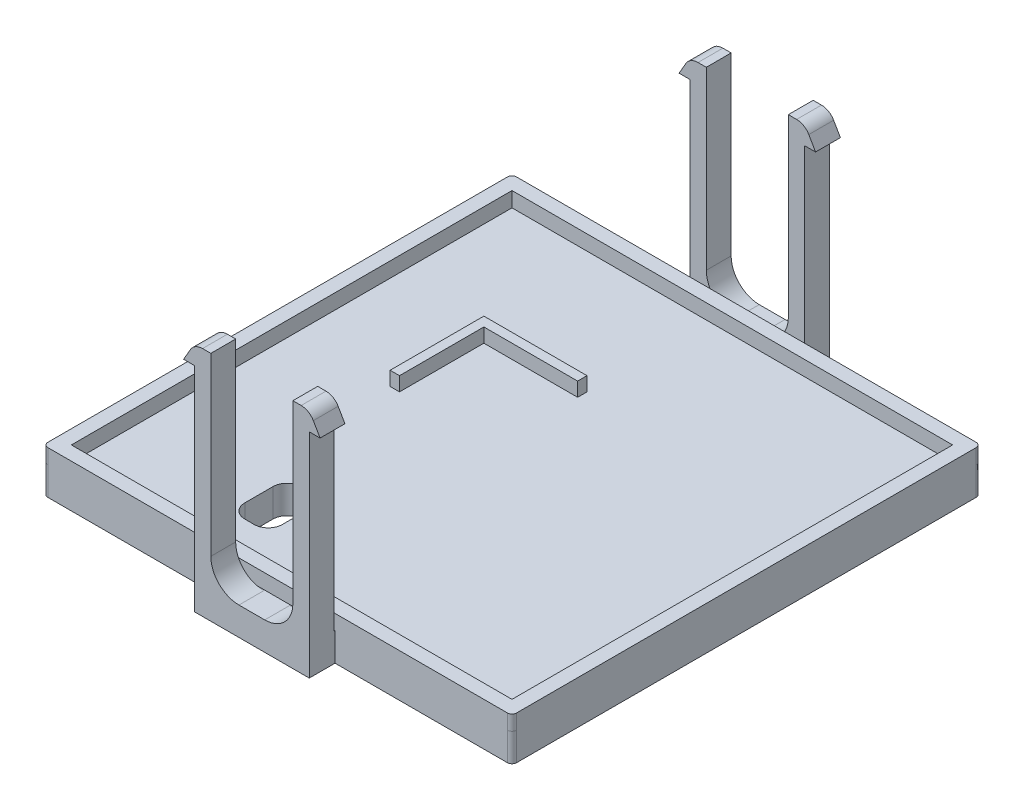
from build123d import *

# Parameters (mm, degrees)
SKETCH1_W            = 73
SKETCH1_H            = 68
BOSS_EXTRUDE1_DEPTH  = 20
SKETCH2_W            = 67
SKETCH2_H            = 62
CUT_EXTRUDE1_DEPTH   = 20
SKETCH3_W            = 100
SKETCH3_H            = 100
BOSS_EXTRUDE2_DEPTH  = 2
FILLET1_R            = 1
SKETCH4_W            = 24.5
SKETCH4_H            = 5.5
BOSS_EXTRUDE3_DEPTH  = 2
BOSS_EXTRUDE4_DEPTH  = 5.3
FILLET2_R            = 6
FILLET2_OF_MIRROR1_R = 6
SKETCH6_W            = 100
SKETCH6_H            = 100
SKETCH6_W_2          = 94
SKETCH6_H_2          = 94
BOSS_EXTRUDE5_DEPTH  = 3.2
FILLET3_R            = 1
SKETCH7_W            = 68
SKETCH7_H            = 18
CUT_EXTRUDE2_DEPTH   = 73
BOSS_EXTRUDE6_DEPTH  = 3
CUT_EXTRUDE3_DEPTH   = 3
BOSS_EXTRUDE8_DEPTH  = 4


with BuildPart() as part:
    # Sketch1 → Boss-Extrude1 (new body)
    with BuildSketch(Plane(origin=(0, 0, 0), x_dir=(1, 0, 0), z_dir=(0, 1, 0))):
        Rectangle(SKETCH1_W, SKETCH1_H)
    extrude(amount=BOSS_EXTRUDE1_DEPTH)

    # Sketch2 → Cut-Extrude1 (cut)
    with BuildSketch(Plane(origin=(0, 20, 0), x_dir=(1, 0, 0), z_dir=(0, 1, 0))):
        Rectangle(SKETCH2_W, SKETCH2_H)
    extrude(amount=-CUT_EXTRUDE1_DEPTH, mode=Mode.SUBTRACT)

    # Sketch3 → Boss-Extrude2 (add)
    with BuildSketch(Plane.XZ):
        Rectangle(SKETCH3_W, SKETCH3_H)
    extrude(amount=-BOSS_EXTRUDE2_DEPTH)

    # Fillet1
    fillet1_edges = [part.edges().sort_by_distance(p)[0] for p in [
        (50, 1, 50),
        (50, 1, -50),
        (-50, 1, -50),
        (-50, 1, 50),
    ]]
    fillet(fillet1_edges, radius=FILLET1_R)

    # Sketch4 → Boss-Extrude3 (add)
    with BuildSketch(Plane(origin=(0, 2, 0), x_dir=(1, 0, 0), z_dir=(0, 1, 0))):
        with Locations((0, 52.75)):
            Rectangle(SKETCH4_W, SKETCH4_H)
    boss_extrude3 = extrude(amount=-BOSS_EXTRUDE3_DEPTH)

    # Sketch5 → Boss-Extrude4 (add)
    with BuildSketch(Plane(origin=(0, 0, -55.5), x_dir=(-1, 0, 0), z_dir=(0, 0, -1))):
        with BuildLine():
            Line((-12.25, 2), (-12.25, 41.5))
            Line((-12.25, 41.5), (-14.559401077, 41.5))
            Line((-14.559401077, 41.5), (-13.116025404, 44))
            ThreePointArc((-13.116025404, 44), (-12.017949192, 45.098076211), (-10.517949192, 45.5))
            Line((-10.517949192, 45.5), (-8.75, 45.5))
            Line((-8.75, 45.5), (-8.75, 2))
            Line((-8.75, 2), (-12.25, 2))
        make_face()
        with BuildLine():
            Line((10.517949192, 45.5), (8.75, 45.5))
            Line((8.75, 45.5), (8.75, 2))
            Line((8.75, 2), (12.25, 2))
            Line((12.25, 2), (12.25, 41.5))
            Line((12.25, 41.5), (14.559401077, 41.5))
            Line((14.559401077, 41.5), (13.116025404, 44))
            ThreePointArc((13.116025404, 44), (12.017949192, 45.098076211), (10.517949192, 45.5))
        make_face()
    boss_extrude4 = extrude(amount=-BOSS_EXTRUDE4_DEPTH)

    # Fillet2
    fillet2_edges = [part.edges().sort_by_distance(p)[0] for p in [
        (-8.75, 2, -52.85),
        (8.75, 2, -52.85),
    ]]
    fillet(fillet2_edges, radius=FILLET2_R)

    # Mirror1: Boss-Extrude3, Boss-Extrude4 across plane
    add(boss_extrude3.mirror(Plane.XY))
    add(boss_extrude4.mirror(Plane.XY))

    # Fillet2 of Mirror1
    fillet2_of_mirror1_edges = [part.edges().sort_by_distance(p)[0] for p in [
        (-8.75, 2, 52.85),
        (8.75, 2, 52.85),
    ]]
    fillet(fillet2_of_mirror1_edges, radius=FILLET2_OF_MIRROR1_R)

    # Sketch6 → Boss-Extrude5 (add)
    with BuildSketch(Plane(origin=(0, 2, 0), x_dir=(1, 0, 0), z_dir=(0, 1, 0))):
        Rectangle(SKETCH6_W, SKETCH6_H)
        Rectangle(SKETCH6_W_2, SKETCH6_H_2, mode=Mode.SUBTRACT)
    extrude(amount=BOSS_EXTRUDE5_DEPTH)

    # Fillet3
    fillet3_edges = [part.edges().sort_by_distance(p)[0] for p in [
        (-50, 3.6, 50),
        (-50, 3.6, -50),
        (50, 3.6, -50),
        (50, 3.6, 50),
    ]]
    fillet(fillet3_edges, radius=FILLET3_R)

    # Sketch7 → Cut-Extrude2 (cut)
    with BuildSketch(Plane(origin=(36.5, 0, 0), x_dir=(0, 0, -1), z_dir=(1, 0, 0))):
        with Locations((0, 11)):
            Rectangle(SKETCH7_W, SKETCH7_H)
    extrude(amount=-CUT_EXTRUDE2_DEPTH, mode=Mode.SUBTRACT)

    # Sketch8 → Boss-Extrude6 (add)
    with BuildSketch(Plane(origin=(0, 2, 0), x_dir=(1, 0, 0), z_dir=(0, 1, 0))):
        Polygon((-27, 1), (-27, 21), (-5, 21), (-5, 19), (-25, 19), (-25, 1), align=None)
    extrude(amount=BOSS_EXTRUDE6_DEPTH)

    # Sketch9 → Cut-Extrude3 (cut)
    with BuildSketch(Plane(origin=(0, 2, 0), x_dir=(1, 0, 0), z_dir=(0, 1, 0))):
        with BuildLine():
            Line((-18, -39), (-16, -39))
            ThreePointArc((-16, -39), (-13.878679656, -38.121320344), (-13, -36))
            Line((-13, -36), (-13, -30))
            ThreePointArc((-13, -30), (-13.878679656, -27.878679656), (-16, -27))
            Line((-16, -27), (-18, -27))
            ThreePointArc((-18, -27), (-20.121320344, -27.878679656), (-21, -30))
            Line((-21, -30), (-21, -36))
            ThreePointArc((-21, -36), (-20.121320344, -38.121320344), (-18, -39))
        make_face()
    extrude(amount=-CUT_EXTRUDE3_DEPTH, mode=Mode.SUBTRACT)

    # Sketch10 → Boss-Extrude8 (add)
    with BuildSketch(Plane.XZ):
        with BuildLine():
            Line((-50, 49), (-50, -49))
            ThreePointArc((-50, -49), (-49.707106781, -49.707106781), (-49, -50))
            Line((-49, -50), (-12.25, -50))
            Line((-12.25, -50), (-12.25, -55.5))
            Line((-12.25, -55.5), (12.25, -55.5))
            Line((12.25, -55.5), (12.25, -50))
            Line((12.25, -50), (49, -50))
            ThreePointArc((49, -50), (49.707106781, -49.707106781), (50, -49))
            Line((50, -49), (50, 49))
            ThreePointArc((50, 49), (49.707106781, 49.707106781), (49, 50))
            Line((49, 50), (12.25, 50))
            Line((12.25, 50), (12.25, 55.5))
            Line((12.25, 55.5), (-12.25, 55.5))
            Line((-12.25, 55.5), (-12.25, 50))
            Line((-12.25, 50), (-49, 50))
            ThreePointArc((-49, 50), (-49.707106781, 49.707106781), (-50, 49))
        make_face()
        with BuildLine():
            Line((-18, 39), (-16, 39))
            ThreePointArc((-16, 39), (-13.878679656, 38.121320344), (-13, 36))
            Line((-13, 36), (-13, 30))
            ThreePointArc((-13, 30), (-13.878679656, 27.878679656), (-16, 27))
            Line((-16, 27), (-18, 27))
            ThreePointArc((-18, 27), (-20.121320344, 27.878679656), (-21, 30))
            Line((-21, 30), (-21, 36))
            ThreePointArc((-21, 36), (-20.121320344, 38.121320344), (-18, 39))
        make_face(mode=Mode.SUBTRACT)
    extrude(amount=BOSS_EXTRUDE8_DEPTH)


solid = part.part
